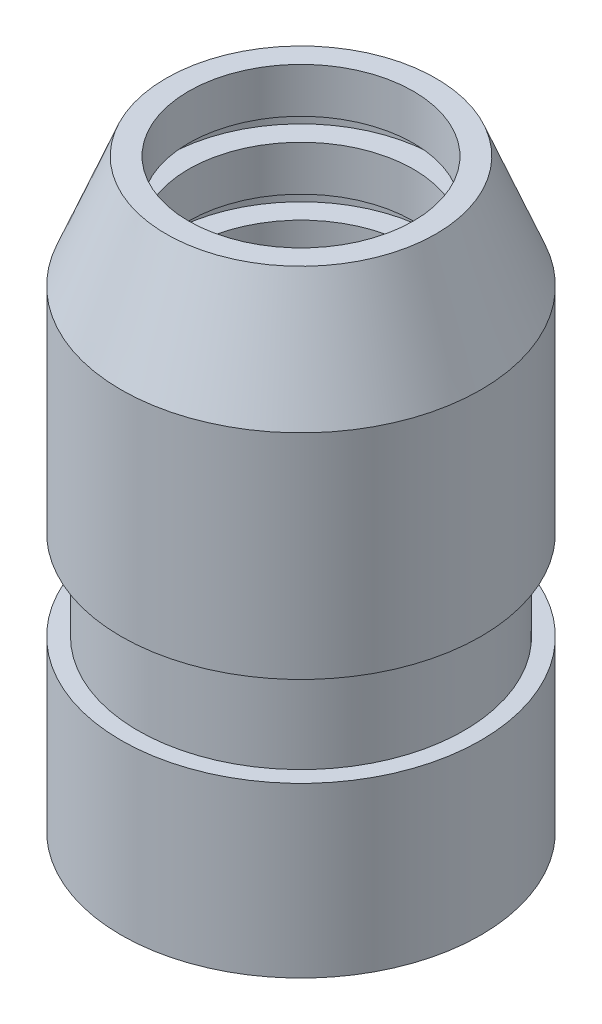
from build123d import *


with BuildPart() as part:
    # Esquisse1 → R_volution1 (revolve)
    with BuildSketch(Plane.XY, mode=Mode.PRIVATE) as r_volution1_sk:
        Polygon((6.5, 0), (6.5, 4.5), (5, 4.5), (5, 16), (6, 16), (6, 17), (5, 17), (5, 19), (6, 19), (6, 20), (5, 20), (5, 22), (6, 22), (8, 17), (8, 7.5), (7.25, 7.5), (7.25, 3.5), (8, 3.5), (8, -4), (7.5, -4), (7.5, 0), align=None)
    revolve(r_volution1_sk.sketch.rotate(Axis((0, 37.723746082, 0), (0, -1, 0)), 180), axis=Axis((0, 37.723746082, 0), (0, -1, 0)))


solid = part.part
